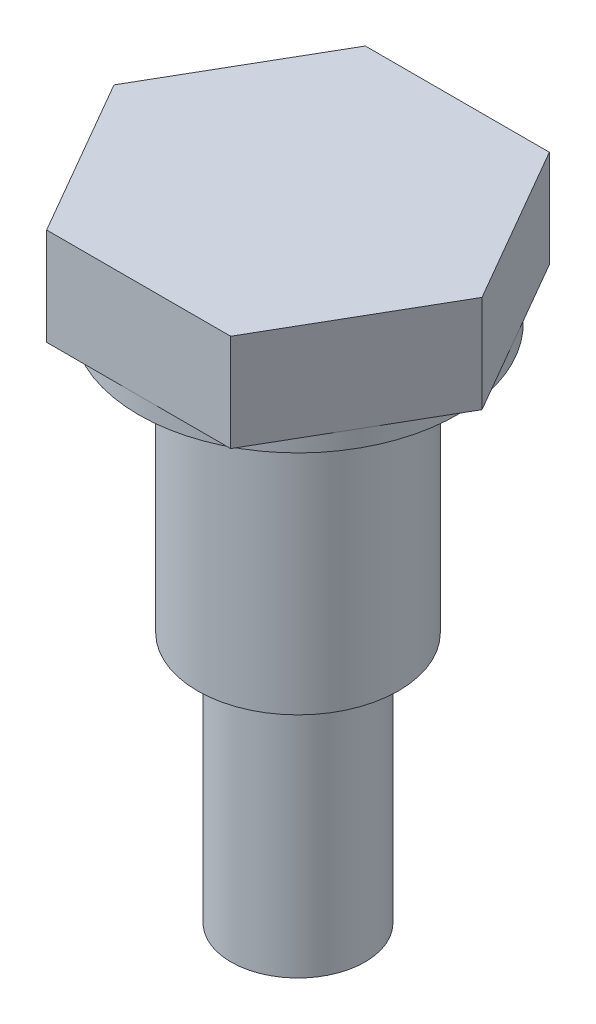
from build123d import *

# Parameters (mm, degrees)
SKETCH1_R      = 4
EXTRUDE1_DEPTH = 15
SKETCH2_R      = 6
EXTRUDE2_DEPTH = 16
SKETCH3_R      = 9.5
EXTRUDE3_DEPTH = 1
EXTRUDE4_DEPTH = 5.8


with BuildPart() as part:
    # Sketch1 → Extrude1 (new body)
    with BuildSketch(Plane(origin=(0, 0, 0), x_dir=(1, 0, 0), z_dir=(0, 1, 0))):
        with Locations(Location((0, 0, 0), (0, 0, 270))):
            Circle(SKETCH1_R)
    extrude(amount=EXTRUDE1_DEPTH)

    # Sketch2 → Extrude2 (add)
    with BuildSketch(Plane(origin=(0, 15, 0), x_dir=(1, 0, 0), z_dir=(0, 1, 0))):
        with Locations(Location((0, 0, 0), (0, 0, 270))):
            Circle(SKETCH2_R)
    extrude(amount=EXTRUDE2_DEPTH)

    # Sketch3 → Extrude3 (add)
    with BuildSketch(Plane(origin=(0, 31, 0), x_dir=(1, 0, 0), z_dir=(0, 1, 0))):
        with Locations(Location((0, 0, 0), (0, 0, 270))):
            Circle(SKETCH3_R)
    extrude(amount=EXTRUDE3_DEPTH)

    # Sketch4 → Extrude4 (add)
    with BuildSketch(Plane(origin=(0, 32, 0), x_dir=(1, 0, 0), z_dir=(0, 1, 0))):
        Polygon((-5.484827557, 9.5), (5.484827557, 9.5), (10.969655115, 0), (5.484827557, -9.5), (-5.484827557, -9.5), (-10.969655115, 0), align=None)
    extrude(amount=EXTRUDE4_DEPTH)


solid = part.part
